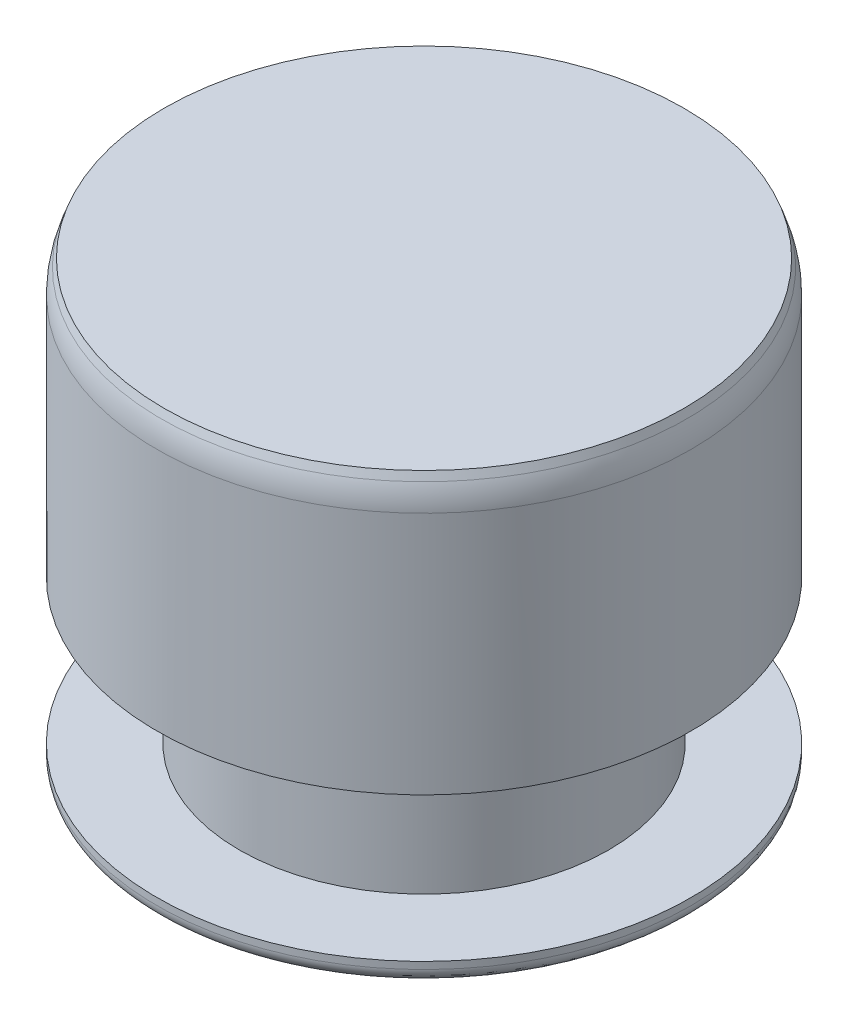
from build123d import *

# Parameters (mm, degrees)
FILLET1_R = 0.2
FILLET2_R = 1


with BuildPart() as part:
    # Sketch1 → Revolve1 (revolve)
    with BuildSketch(Plane.XY, mode=Mode.PRIVATE) as revolve1_sk:
        Polygon((0, 0), (0, -8.011324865), (0.5, -8.011324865), (3.76, -6.129162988), (3.76, -5.915), (2.6, -5.915), (2.6, -3.885), (3.76, -3.885), (3.76, -0.274747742), (3.66, 0), align=None)
    revolve(revolve1_sk.sketch.rotate(Axis((0, 0, 0), (0, -1, 0)), 180), axis=Axis((0, 0, 0), (0, -1, 0)))

    # Fillet1
    fillet1_edges = [part.edges().sort_by_distance(p)[0] for p in [
        (3.76, -6.129162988, 0),
    ]]
    fillet(fillet1_edges, radius=FILLET1_R)

    # Fillet2
    fillet2_edges = [part.edges().sort_by_distance(p)[0] for p in [
        (3.76, -0.274747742, 0),
    ]]
    fillet(fillet2_edges, radius=FILLET2_R)


solid = part.part
